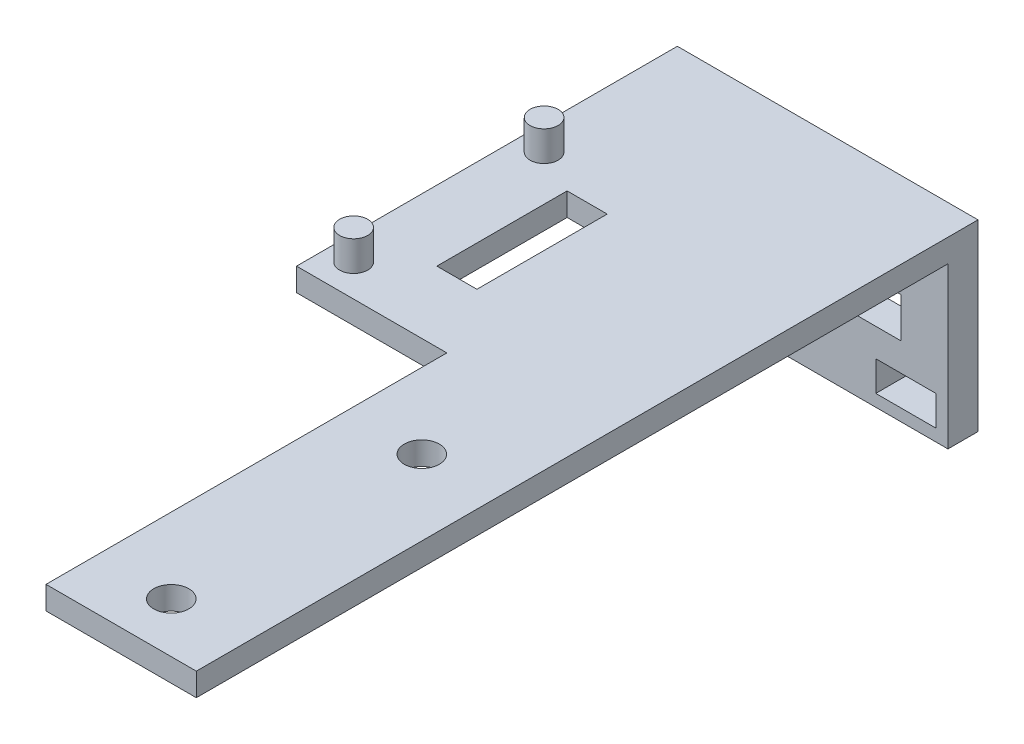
ISO-10303-21;
HEADER;
FILE_DESCRIPTION(('STEP AP214'),'2;1');
FILE_NAME('part.step','',(''),(''),'','','');
FILE_SCHEMA(('AUTOMOTIVE_DESIGN { 1 0 10303 214 1 1 1 1 }'));
ENDSEC;
DATA;
#1=APPLICATION_CONTEXT('core data for automotive mechanical design processes');
#2=APPLICATION_PROTOCOL_DEFINITION('international standard','automotive_design',2000,#1);
#3=PRODUCT_CONTEXT('',#1,'mechanical');
#4=PRODUCT('Part','Part','',(#3));
#5=PRODUCT_RELATED_PRODUCT_CATEGORY('part','',(#4));
#6=PRODUCT_DEFINITION_FORMATION('','',#4);
#7=PRODUCT_DEFINITION_CONTEXT('part definition',#1,'design');
#8=PRODUCT_DEFINITION('design','',#6,#7);
#9=PRODUCT_DEFINITION_SHAPE('','',#8);
#10=(LENGTH_UNIT() NAMED_UNIT(*) SI_UNIT(.MILLI.,.METRE.));
#11=(NAMED_UNIT(*) PLANE_ANGLE_UNIT() SI_UNIT($,.RADIAN.));
#12=(NAMED_UNIT(*) SI_UNIT($,.STERADIAN.) SOLID_ANGLE_UNIT());
#13=UNCERTAINTY_MEASURE_WITH_UNIT(LENGTH_MEASURE(1.E-05),#10,'distance_accuracy_value','');
#14=(GEOMETRIC_REPRESENTATION_CONTEXT(3) GLOBAL_UNCERTAINTY_ASSIGNED_CONTEXT((#13)) GLOBAL_UNIT_ASSIGNED_CONTEXT((#10,
#11,#12)) REPRESENTATION_CONTEXT('',''));
#15=CARTESIAN_POINT('',(0.,0.,0.));
#16=DIRECTION('',(0.,0.,1.));
#17=DIRECTION('',(1.,0.,0.));
#18=AXIS2_PLACEMENT_3D('',#15,#16,#17);
#19=CARTESIAN_POINT('',(-7.5,-2.3,32.5));
#20=DIRECTION('',(0.,0.,1.));
#21=DIRECTION('',(1.,0.,0.));
#22=AXIS2_PLACEMENT_3D('',#19,#20,#21);
#23=PLANE('',#22);
#24=DIRECTION('',(1.,0.,0.));
#25=VECTOR('',#24,1.);
#26=CARTESIAN_POINT('',(-7.5,0.,32.5));
#27=LINE('',#26,#25);
#28=CARTESIAN_POINT('',(-7.5,0.,32.5));
#29=VERTEX_POINT('',#28);
#30=CARTESIAN_POINT('',(7.5,0.,32.5));
#31=VERTEX_POINT('',#30);
#32=EDGE_CURVE('E402',#29,#31,#27,.T.);
#33=ORIENTED_EDGE('',*,*,#32,.F.);
#34=DIRECTION('',(0.,1.,0.));
#35=VECTOR('',#34,1.);
#36=CARTESIAN_POINT('',(-7.5,-2.3,32.5));
#37=LINE('',#36,#35);
#38=CARTESIAN_POINT('',(-7.5,-2.3,32.5));
#39=VERTEX_POINT('',#38);
#40=EDGE_CURVE('E445',#39,#29,#37,.T.);
#41=ORIENTED_EDGE('',*,*,#40,.F.);
#42=DIRECTION('',(1.,0.,0.));
#43=VECTOR('',#42,1.);
#44=CARTESIAN_POINT('',(-7.5,-2.3,32.5));
#45=LINE('',#44,#43);
#46=CARTESIAN_POINT('',(7.5,-2.3,32.5));
#47=VERTEX_POINT('',#46);
#48=EDGE_CURVE('E413',#39,#47,#45,.T.);
#49=ORIENTED_EDGE('',*,*,#48,.T.);
#50=DIRECTION('',(0.,1.,0.));
#51=VECTOR('',#50,1.);
#52=CARTESIAN_POINT('',(7.5,-2.3,32.5));
#53=LINE('',#52,#51);
#54=EDGE_CURVE('E440',#47,#31,#53,.T.);
#55=ORIENTED_EDGE('',*,*,#54,.T.);
#56=EDGE_LOOP('',(#33,#41,#49,#55));
#57=FACE_BOUND('',#56,.T.);
#58=ADVANCED_FACE('F39',(#57),#23,.T.);
#59=CARTESIAN_POINT('',(-7.5,-2.3,-7.50000000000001));
#60=DIRECTION('',(-1.,0.,0.));
#61=DIRECTION('',(0.,0.,1.));
#62=AXIS2_PLACEMENT_3D('',#59,#60,#61);
#63=PLANE('',#62);
#64=DIRECTION('',(0.,0.,1.));
#65=VECTOR('',#64,1.);
#66=CARTESIAN_POINT('',(-7.5,0.,-7.50000000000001));
#67=LINE('',#66,#65);
#68=CARTESIAN_POINT('',(-7.5,0.,-7.50000000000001));
#69=VERTEX_POINT('',#68);
#70=EDGE_CURVE('E433',#69,#29,#67,.T.);
#71=ORIENTED_EDGE('',*,*,#70,.F.);
#72=DIRECTION('',(0.,1.,0.));
#73=VECTOR('',#72,1.);
#74=CARTESIAN_POINT('',(-7.5,-2.3,-7.50000000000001));
#75=LINE('',#74,#73);
#76=CARTESIAN_POINT('',(-7.5,-2.3,-7.50000000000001));
#77=VERTEX_POINT('',#76);
#78=EDGE_CURVE('E448',#77,#69,#75,.T.);
#79=ORIENTED_EDGE('',*,*,#78,.F.);
#80=DIRECTION('',(0.,0.,1.));
#81=VECTOR('',#80,1.);
#82=CARTESIAN_POINT('',(-7.5,-2.3,-7.50000000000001));
#83=LINE('',#82,#81);
#84=EDGE_CURVE('E409',#77,#39,#83,.T.);
#85=ORIENTED_EDGE('',*,*,#84,.T.);
#86=ORIENTED_EDGE('',*,*,#40,.T.);
#87=EDGE_LOOP('',(#71,#79,#85,#86));
#88=FACE_BOUND('',#87,.T.);
#89=ADVANCED_FACE('F522',(#88),#63,.T.);
#90=CARTESIAN_POINT('',(-7.5,-2.3,-7.50000000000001));
#91=DIRECTION('',(0.,0.,1.));
#92=DIRECTION('',(1.,0.,0.));
#93=AXIS2_PLACEMENT_3D('',#90,#91,#92);
#94=PLANE('',#93);
#95=DIRECTION('',(1.,0.,0.));
#96=VECTOR('',#95,1.);
#97=CARTESIAN_POINT('',(-7.5,0.,-7.50000000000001));
#98=LINE('',#97,#96);
#99=CARTESIAN_POINT('',(-22.5,0.,-7.5));
#100=VERTEX_POINT('',#99);
#101=EDGE_CURVE('E429',#100,#69,#98,.T.);
#102=ORIENTED_EDGE('',*,*,#101,.F.);
#103=DIRECTION('',(0.,1.,0.));
#104=VECTOR('',#103,1.);
#105=CARTESIAN_POINT('',(-22.5,-2.3,-7.5));
#106=LINE('',#105,#104);
#107=CARTESIAN_POINT('',(-22.5,-2.3,-7.5));
#108=VERTEX_POINT('',#107);
#109=EDGE_CURVE('E451',#108,#100,#106,.T.);
#110=ORIENTED_EDGE('',*,*,#109,.F.);
#111=DIRECTION('',(1.,0.,0.));
#112=VECTOR('',#111,1.);
#113=CARTESIAN_POINT('',(-7.5,-2.3,-7.50000000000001));
#114=LINE('',#113,#112);
#115=EDGE_CURVE('E405',#108,#77,#114,.T.);
#116=ORIENTED_EDGE('',*,*,#115,.T.);
#117=ORIENTED_EDGE('',*,*,#78,.T.);
#118=EDGE_LOOP('',(#102,#110,#116,#117));
#119=FACE_BOUND('',#118,.T.);
#120=ADVANCED_FACE('F518',(#119),#94,.T.);
#121=CARTESIAN_POINT('',(-22.5,-2.3,-32.5));
#122=DIRECTION('',(-1.,0.,0.));
#123=DIRECTION('',(0.,0.,1.));
#124=AXIS2_PLACEMENT_3D('',#121,#122,#123);
#125=PLANE('',#124);
#126=DIRECTION('',(0.,0.,1.));
#127=VECTOR('',#126,1.);
#128=CARTESIAN_POINT('',(-22.5,0.,-32.5));
#129=LINE('',#128,#127);
#130=CARTESIAN_POINT('',(-22.5,0.,-45.5));
#131=VERTEX_POINT('',#130);
#132=EDGE_CURVE('E425',#131,#100,#129,.T.);
#133=ORIENTED_EDGE('',*,*,#132,.F.);
#134=DIRECTION('',(0.,1.,0.));
#135=VECTOR('',#134,1.);
#136=CARTESIAN_POINT('',(-22.5,-2.3,-45.5));
#137=LINE('',#136,#135);
#138=CARTESIAN_POINT('',(-22.5,-18.3,-45.5));
#139=VERTEX_POINT('',#138);
#140=EDGE_CURVE('E454',#139,#131,#137,.T.);
#141=ORIENTED_EDGE('',*,*,#140,.F.);
#142=DIRECTION('',(0.,0.,1.));
#143=VECTOR('',#142,1.);
#144=CARTESIAN_POINT('',(-22.5,-18.3,0.));
#145=LINE('',#144,#143);
#146=CARTESIAN_POINT('',(-22.5,-18.3,-42.5));
#147=VERTEX_POINT('',#146);
#148=EDGE_CURVE('E307',#139,#147,#145,.T.);
#149=ORIENTED_EDGE('',*,*,#148,.T.);
#150=DIRECTION('',(0.,1.,0.));
#151=VECTOR('',#150,1.);
#152=CARTESIAN_POINT('',(-22.5,-18.3,-42.5));
#153=LINE('',#152,#151);
#154=CARTESIAN_POINT('',(-22.5,-2.3,-42.5));
#155=VERTEX_POINT('',#154);
#156=EDGE_CURVE('E315',#147,#155,#153,.T.);
#157=ORIENTED_EDGE('',*,*,#156,.T.);
#158=DIRECTION('',(0.,0.,1.));
#159=VECTOR('',#158,1.);
#160=CARTESIAN_POINT('',(-22.5,-2.3,-32.5));
#161=LINE('',#160,#159);
#162=EDGE_CURVE('E401',#155,#108,#161,.T.);
#163=ORIENTED_EDGE('',*,*,#162,.T.);
#164=ORIENTED_EDGE('',*,*,#109,.T.);
#165=EDGE_LOOP('',(#133,#141,#149,#157,#163,#164));
#166=FACE_BOUND('',#165,.T.);
#167=ADVANCED_FACE('F511',(#166),#125,.T.);
#168=CARTESIAN_POINT('',(-22.5,-2.3,-45.5));
#169=DIRECTION('',(0.,0.,-1.));
#170=DIRECTION('',(-1.,0.,0.));
#171=AXIS2_PLACEMENT_3D('',#168,#169,#170);
#172=PLANE('',#171);
#173=DIRECTION('',(0.,1.,0.));
#174=VECTOR('',#173,1.);
#175=CARTESIAN_POINT('',(-18.7,-14.1,-45.5));
#176=LINE('',#175,#174);
#177=CARTESIAN_POINT('',(-18.7,-17.1,-45.5));
#178=VERTEX_POINT('',#177);
#179=CARTESIAN_POINT('',(-18.7,-14.1,-45.5));
#180=VERTEX_POINT('',#179);
#181=EDGE_CURVE('E55',#178,#180,#176,.T.);
#182=ORIENTED_EDGE('',*,*,#181,.F.);
#183=DIRECTION('',(-1.,0.,0.));
#184=VECTOR('',#183,1.);
#185=CARTESIAN_POINT('',(-12.7,-17.1,-45.5));
#186=LINE('',#185,#184);
#187=CARTESIAN_POINT('',(-12.7,-17.1,-45.5));
#188=VERTEX_POINT('',#187);
#189=EDGE_CURVE('E251',#188,#178,#186,.T.);
#190=ORIENTED_EDGE('',*,*,#189,.F.);
#191=DIRECTION('',(0.,-1.,0.));
#192=VECTOR('',#191,1.);
#193=CARTESIAN_POINT('',(-12.7,-14.1,-45.5));
#194=LINE('',#193,#192);
#195=CARTESIAN_POINT('',(-12.7,-14.1,-45.5));
#196=VERTEX_POINT('',#195);
#197=EDGE_CURVE('E247',#196,#188,#194,.T.);
#198=ORIENTED_EDGE('',*,*,#197,.F.);
#199=DIRECTION('',(1.,0.,0.));
#200=VECTOR('',#199,1.);
#201=CARTESIAN_POINT('',(-12.7,-14.1,-45.5));
#202=LINE('',#201,#200);
#203=EDGE_CURVE('E243',#180,#196,#202,.T.);
#204=ORIENTED_EDGE('',*,*,#203,.F.);
#205=EDGE_LOOP('',(#182,#190,#198,#204));
#206=FACE_BOUND('',#205,.T.);
#207=DIRECTION('',(0.,1.,0.));
#208=VECTOR('',#207,1.);
#209=CARTESIAN_POINT('',(-15.2,-7.3,-45.5));
#210=LINE('',#209,#208);
#211=CARTESIAN_POINT('',(-15.2,-11.3,-45.5));
#212=VERTEX_POINT('',#211);
#213=CARTESIAN_POINT('',(-15.2,-7.3,-45.5));
#214=VERTEX_POINT('',#213);
#215=EDGE_CURVE('E63',#212,#214,#210,.T.);
#216=ORIENTED_EDGE('',*,*,#215,.F.);
#217=DIRECTION('',(-1.,0.,0.));
#218=VECTOR('',#217,1.);
#219=CARTESIAN_POINT('',(2.79999999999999,-11.3,-45.5));
#220=LINE('',#219,#218);
#221=CARTESIAN_POINT('',(2.79999999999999,-11.3,-45.5));
#222=VERTEX_POINT('',#221);
#223=EDGE_CURVE('E226',#222,#212,#220,.T.);
#224=ORIENTED_EDGE('',*,*,#223,.F.);
#225=DIRECTION('',(0.,-1.,0.));
#226=VECTOR('',#225,1.);
#227=CARTESIAN_POINT('',(2.79999999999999,-7.3,-45.5));
#228=LINE('',#227,#226);
#229=CARTESIAN_POINT('',(2.79999999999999,-7.3,-45.5));
#230=VERTEX_POINT('',#229);
#231=EDGE_CURVE('E207',#230,#222,#228,.T.);
#232=ORIENTED_EDGE('',*,*,#231,.F.);
#233=DIRECTION('',(1.,0.,0.));
#234=VECTOR('',#233,1.);
#235=CARTESIAN_POINT('',(2.79999999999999,-7.3,-45.5));
#236=LINE('',#235,#234);
#237=EDGE_CURVE('E218',#214,#230,#236,.T.);
#238=ORIENTED_EDGE('',*,*,#237,.F.);
#239=EDGE_LOOP('',(#216,#224,#232,#238));
#240=FACE_BOUND('',#239,.T.);
#241=DIRECTION('',(0.,1.,0.));
#242=VECTOR('',#241,1.);
#243=CARTESIAN_POINT('',(0.299999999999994,-14.1,-45.5));
#244=LINE('',#243,#242);
#245=CARTESIAN_POINT('',(0.299999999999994,-17.1,-45.5));
#246=VERTEX_POINT('',#245);
#247=CARTESIAN_POINT('',(0.299999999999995,-14.1,-45.5));
#248=VERTEX_POINT('',#247);
#249=EDGE_CURVE('E236',#246,#248,#244,.T.);
#250=ORIENTED_EDGE('',*,*,#249,.F.);
#251=DIRECTION('',(-1.,0.,0.));
#252=VECTOR('',#251,1.);
#253=CARTESIAN_POINT('',(6.29999999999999,-17.1,-45.5));
#254=LINE('',#253,#252);
#255=CARTESIAN_POINT('',(6.29999999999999,-17.1,-45.5));
#256=VERTEX_POINT('',#255);
#257=EDGE_CURVE('E277',#256,#246,#254,.T.);
#258=ORIENTED_EDGE('',*,*,#257,.F.);
#259=DIRECTION('',(0.,-1.,0.));
#260=VECTOR('',#259,1.);
#261=CARTESIAN_POINT('',(6.29999999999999,-14.1,-45.5));
#262=LINE('',#261,#260);
#263=CARTESIAN_POINT('',(6.29999999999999,-14.1,-45.5));
#264=VERTEX_POINT('',#263);
#265=EDGE_CURVE('E273',#264,#256,#262,.T.);
#266=ORIENTED_EDGE('',*,*,#265,.F.);
#267=DIRECTION('',(1.,0.,0.));
#268=VECTOR('',#267,1.);
#269=CARTESIAN_POINT('',(6.29999999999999,-14.1,-45.5));
#270=LINE('',#269,#268);
#271=EDGE_CURVE('E269',#248,#264,#270,.T.);
#272=ORIENTED_EDGE('',*,*,#271,.F.);
#273=EDGE_LOOP('',(#250,#258,#266,#272));
#274=FACE_BOUND('',#273,.T.);
#275=DIRECTION('',(-1.,0.,0.));
#276=VECTOR('',#275,1.);
#277=CARTESIAN_POINT('',(-22.5,0.,-45.5));
#278=LINE('',#277,#276);
#279=CARTESIAN_POINT('',(7.49999999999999,0.,-45.5));
#280=VERTEX_POINT('',#279);
#281=EDGE_CURVE('E421',#280,#131,#278,.T.);
#282=ORIENTED_EDGE('',*,*,#281,.F.);
#283=DIRECTION('',(0.,1.,0.));
#284=VECTOR('',#283,1.);
#285=CARTESIAN_POINT('',(7.49999999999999,-2.3,-45.5));
#286=LINE('',#285,#284);
#287=CARTESIAN_POINT('',(7.49999999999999,-18.3,-45.5));
#288=VERTEX_POINT('',#287);
#289=EDGE_CURVE('E417',#288,#280,#286,.T.);
#290=ORIENTED_EDGE('',*,*,#289,.F.);
#291=DIRECTION('',(-1.,0.,0.));
#292=VECTOR('',#291,1.);
#293=CARTESIAN_POINT('',(0.,-18.3,-45.5));
#294=LINE('',#293,#292);
#295=EDGE_CURVE('E303',#288,#139,#294,.T.);
#296=ORIENTED_EDGE('',*,*,#295,.T.);
#297=ORIENTED_EDGE('',*,*,#140,.T.);
#298=EDGE_LOOP('',(#282,#290,#296,#297));
#299=FACE_BOUND('',#298,.T.);
#300=ADVANCED_FACE('F223',(#206,#240,#274,#299),#172,.T.);
#301=CARTESIAN_POINT('',(7.49999999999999,-2.3,-32.5));
#302=DIRECTION('',(1.,0.,0.));
#303=DIRECTION('',(0.,0.,-1.));
#304=AXIS2_PLACEMENT_3D('',#301,#302,#303);
#305=PLANE('',#304);
#306=DIRECTION('',(0.,0.,-1.));
#307=VECTOR('',#306,1.);
#308=CARTESIAN_POINT('',(7.49999999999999,0.,-32.5));
#309=LINE('',#308,#307);
#310=EDGE_CURVE('E393',#31,#280,#309,.T.);
#311=ORIENTED_EDGE('',*,*,#310,.F.);
#312=ORIENTED_EDGE('',*,*,#54,.F.);
#313=DIRECTION('',(0.,0.,-1.));
#314=VECTOR('',#313,1.);
#315=CARTESIAN_POINT('',(7.49999999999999,-2.3,-32.5));
#316=LINE('',#315,#314);
#317=CARTESIAN_POINT('',(7.49999999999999,-2.3,-42.5));
#318=VERTEX_POINT('',#317);
#319=EDGE_CURVE('E397',#47,#318,#316,.T.);
#320=ORIENTED_EDGE('',*,*,#319,.T.);
#321=DIRECTION('',(0.,1.,0.));
#322=VECTOR('',#321,1.);
#323=CARTESIAN_POINT('',(7.5,-18.3,-42.5));
#324=LINE('',#323,#322);
#325=CARTESIAN_POINT('',(7.5,-18.3,-42.5));
#326=VERTEX_POINT('',#325);
#327=EDGE_CURVE('E311',#326,#318,#324,.T.);
#328=ORIENTED_EDGE('',*,*,#327,.F.);
#329=DIRECTION('',(0.,0.,-1.));
#330=VECTOR('',#329,1.);
#331=CARTESIAN_POINT('',(7.50000000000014,-18.3,0.));
#332=LINE('',#331,#330);
#333=EDGE_CURVE('E299',#326,#288,#332,.T.);
#334=ORIENTED_EDGE('',*,*,#333,.T.);
#335=ORIENTED_EDGE('',*,*,#289,.T.);
#336=EDGE_LOOP('',(#311,#312,#320,#328,#334,#335));
#337=FACE_BOUND('',#336,.T.);
#338=ADVANCED_FACE('F41',(#337),#305,.T.);
#339=CARTESIAN_POINT('',(0.,-2.3,0.));
#340=DIRECTION('',(0.,1.,0.));
#341=DIRECTION('',(0.,0.,1.));
#342=AXIS2_PLACEMENT_3D('',#339,#340,#341);
#343=PLANE('',#342);
#344=DIRECTION('',(1.,0.,0.));
#345=VECTOR('',#344,1.);
#346=CARTESIAN_POINT('',(-15.5,-2.3,-14.5));
#347=LINE('',#346,#345);
#348=CARTESIAN_POINT('',(-15.5,-2.3,-14.5));
#349=VERTEX_POINT('',#348);
#350=CARTESIAN_POINT('',(-11.5,-2.3,-14.5));
#351=VERTEX_POINT('',#350);
#352=EDGE_CURVE('E350',#349,#351,#347,.T.);
#353=ORIENTED_EDGE('',*,*,#352,.T.);
#354=DIRECTION('',(0.,0.,-1.));
#355=VECTOR('',#354,1.);
#356=CARTESIAN_POINT('',(-11.5,-2.3,-27.5));
#357=LINE('',#356,#355);
#358=CARTESIAN_POINT('',(-11.5,-2.3,-27.5));
#359=VERTEX_POINT('',#358);
#360=EDGE_CURVE('E337',#351,#359,#357,.T.);
#361=ORIENTED_EDGE('',*,*,#360,.T.);
#362=DIRECTION('',(-1.,0.,0.));
#363=VECTOR('',#362,1.);
#364=CARTESIAN_POINT('',(-15.5,-2.3,-27.5));
#365=LINE('',#364,#363);
#366=CARTESIAN_POINT('',(-15.5,-2.3,-27.5));
#367=VERTEX_POINT('',#366);
#368=EDGE_CURVE('E341',#359,#367,#365,.T.);
#369=ORIENTED_EDGE('',*,*,#368,.T.);
#370=DIRECTION('',(0.,0.,1.));
#371=VECTOR('',#370,1.);
#372=CARTESIAN_POINT('',(-15.5,-2.3,-27.5));
#373=LINE('',#372,#371);
#374=EDGE_CURVE('E346',#367,#349,#373,.T.);
#375=ORIENTED_EDGE('',*,*,#374,.T.);
#376=EDGE_LOOP('',(#353,#361,#369,#375));
#377=FACE_BOUND('',#376,.T.);
#378=CARTESIAN_POINT('',(0.,-2.3,2.5));
#379=DIRECTION('',(0.,1.,0.));
#380=DIRECTION('',(0.,0.,1.));
#381=AXIS2_PLACEMENT_3D('',#378,#379,#380);
#382=CIRCLE('',#381,1.75);
#383=CARTESIAN_POINT('',(0.,-2.3,4.24999999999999));
#384=VERTEX_POINT('',#383);
#385=EDGE_CURVE('E381',#384,#384,#382,.T.);
#386=ORIENTED_EDGE('',*,*,#385,.T.);
#387=EDGE_LOOP('',(#386));
#388=FACE_BOUND('',#387,.T.);
#389=CARTESIAN_POINT('',(0.,-2.3,27.5));
#390=DIRECTION('',(0.,1.,0.));
#391=DIRECTION('',(0.,0.,1.));
#392=AXIS2_PLACEMENT_3D('',#389,#390,#391);
#393=CIRCLE('',#392,1.75);
#394=CARTESIAN_POINT('',(0.,-2.3,29.25));
#395=VERTEX_POINT('',#394);
#396=EDGE_CURVE('E389',#395,#395,#393,.T.);
#397=ORIENTED_EDGE('',*,*,#396,.T.);
#398=EDGE_LOOP('',(#397));
#399=FACE_BOUND('',#398,.T.);
#400=ORIENTED_EDGE('',*,*,#162,.F.);
#401=DIRECTION('',(1.,0.,0.));
#402=VECTOR('',#401,1.);
#403=CARTESIAN_POINT('',(0.,-2.3,-42.5));
#404=LINE('',#403,#402);
#405=EDGE_CURVE('E285',#155,#318,#404,.T.);
#406=ORIENTED_EDGE('',*,*,#405,.T.);
#407=ORIENTED_EDGE('',*,*,#319,.F.);
#408=ORIENTED_EDGE('',*,*,#48,.F.);
#409=ORIENTED_EDGE('',*,*,#84,.F.);
#410=ORIENTED_EDGE('',*,*,#115,.F.);
#411=EDGE_LOOP('',(#400,#406,#407,#408,#409,#410));
#412=FACE_BOUND('',#411,.T.);
#413=ADVANCED_FACE('F516',(#377,#388,#399,#412),#343,.F.);
#414=CARTESIAN_POINT('',(0.,0.,0.));
#415=DIRECTION('',(0.,1.,0.));
#416=DIRECTION('',(0.,0.,1.));
#417=AXIS2_PLACEMENT_3D('',#414,#415,#416);
#418=PLANE('',#417);
#419=CARTESIAN_POINT('',(-20.,0.,-10.7));
#420=DIRECTION('',(0.,1.,0.));
#421=DIRECTION('',(0.,0.,1.));
#422=AXIS2_PLACEMENT_3D('',#419,#420,#421);
#423=CIRCLE('',#422,1.4);
#424=CARTESIAN_POINT('',(-20.,0.,-9.3));
#425=VERTEX_POINT('',#424);
#426=EDGE_CURVE('E318',#425,#425,#423,.T.);
#427=ORIENTED_EDGE('',*,*,#426,.F.);
#428=EDGE_LOOP('',(#427));
#429=FACE_BOUND('',#428,.T.);
#430=CARTESIAN_POINT('',(-20.,0.,-29.7));
#431=DIRECTION('',(0.,1.,0.));
#432=DIRECTION('',(0.,0.,1.));
#433=AXIS2_PLACEMENT_3D('',#430,#431,#432);
#434=CIRCLE('',#433,1.4);
#435=CARTESIAN_POINT('',(-20.,0.,-28.3));
#436=VERTEX_POINT('',#435);
#437=EDGE_CURVE('E325',#436,#436,#434,.T.);
#438=ORIENTED_EDGE('',*,*,#437,.F.);
#439=EDGE_LOOP('',(#438));
#440=FACE_BOUND('',#439,.T.);
#441=DIRECTION('',(0.,0.,-1.));
#442=VECTOR('',#441,1.);
#443=CARTESIAN_POINT('',(-11.5,0.,-27.5));
#444=LINE('',#443,#442);
#445=CARTESIAN_POINT('',(-11.5,0.,-14.5));
#446=VERTEX_POINT('',#445);
#447=CARTESIAN_POINT('',(-11.5,0.,-27.5));
#448=VERTEX_POINT('',#447);
#449=EDGE_CURVE('E333',#446,#448,#444,.T.);
#450=ORIENTED_EDGE('',*,*,#449,.F.);
#451=DIRECTION('',(1.,0.,0.));
#452=VECTOR('',#451,1.);
#453=CARTESIAN_POINT('',(-15.5,0.,-14.5));
#454=LINE('',#453,#452);
#455=CARTESIAN_POINT('',(-15.5,0.,-14.5));
#456=VERTEX_POINT('',#455);
#457=EDGE_CURVE('E342',#456,#446,#454,.T.);
#458=ORIENTED_EDGE('',*,*,#457,.F.);
#459=DIRECTION('',(0.,0.,1.));
#460=VECTOR('',#459,1.);
#461=CARTESIAN_POINT('',(-15.5,0.,-27.5));
#462=LINE('',#461,#460);
#463=CARTESIAN_POINT('',(-15.5,0.,-27.5));
#464=VERTEX_POINT('',#463);
#465=EDGE_CURVE('E361',#464,#456,#462,.T.);
#466=ORIENTED_EDGE('',*,*,#465,.F.);
#467=DIRECTION('',(-1.,0.,0.));
#468=VECTOR('',#467,1.);
#469=CARTESIAN_POINT('',(-15.5,0.,-27.5));
#470=LINE('',#469,#468);
#471=EDGE_CURVE('E357',#448,#464,#470,.T.);
#472=ORIENTED_EDGE('',*,*,#471,.F.);
#473=EDGE_LOOP('',(#450,#458,#466,#472));
#474=FACE_BOUND('',#473,.T.);
#475=CARTESIAN_POINT('',(0.,0.,2.5));
#476=DIRECTION('',(0.,1.,0.));
#477=DIRECTION('',(0.,0.,1.));
#478=AXIS2_PLACEMENT_3D('',#475,#476,#477);
#479=CIRCLE('',#478,1.75);
#480=CARTESIAN_POINT('',(0.,0.,4.24999999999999));
#481=VERTEX_POINT('',#480);
#482=EDGE_CURVE('E371',#481,#481,#479,.T.);
#483=ORIENTED_EDGE('',*,*,#482,.F.);
#484=EDGE_LOOP('',(#483));
#485=FACE_BOUND('',#484,.T.);
#486=CARTESIAN_POINT('',(0.,0.,27.5));
#487=DIRECTION('',(0.,1.,0.));
#488=DIRECTION('',(0.,0.,1.));
#489=AXIS2_PLACEMENT_3D('',#486,#487,#488);
#490=CIRCLE('',#489,1.75);
#491=CARTESIAN_POINT('',(0.,0.,29.25));
#492=VERTEX_POINT('',#491);
#493=EDGE_CURVE('E385',#492,#492,#490,.T.);
#494=ORIENTED_EDGE('',*,*,#493,.F.);
#495=EDGE_LOOP('',(#494));
#496=FACE_BOUND('',#495,.T.);
#497=ORIENTED_EDGE('',*,*,#32,.T.);
#498=ORIENTED_EDGE('',*,*,#310,.T.);
#499=ORIENTED_EDGE('',*,*,#281,.T.);
#500=ORIENTED_EDGE('',*,*,#132,.T.);
#501=ORIENTED_EDGE('',*,*,#101,.T.);
#502=ORIENTED_EDGE('',*,*,#70,.T.);
#503=EDGE_LOOP('',(#497,#498,#499,#500,#501,#502));
#504=FACE_BOUND('',#503,.T.);
#505=ADVANCED_FACE('F532',(#429,#440,#474,#485,#496,#504),#418,.T.);
#506=CARTESIAN_POINT('',(0.,-2.3,27.5));
#507=DIRECTION('',(0.,1.,0.));
#508=DIRECTION('',(0.,0.,1.));
#509=AXIS2_PLACEMENT_3D('',#506,#507,#508);
#510=CYLINDRICAL_SURFACE('',#509,1.75);
#511=ORIENTED_EDGE('',*,*,#396,.F.);
#512=EDGE_LOOP('',(#511));
#513=FACE_BOUND('',#512,.T.);
#514=ORIENTED_EDGE('',*,*,#493,.T.);
#515=EDGE_LOOP('',(#514));
#516=FACE_BOUND('',#515,.T.);
#517=ADVANCED_FACE('F564',(#513,#516),#510,.F.);
#518=CARTESIAN_POINT('',(0.,-2.3,2.5));
#519=DIRECTION('',(0.,1.,0.));
#520=DIRECTION('',(0.,0.,1.));
#521=AXIS2_PLACEMENT_3D('',#518,#519,#520);
#522=CYLINDRICAL_SURFACE('',#521,1.75);
#523=ORIENTED_EDGE('',*,*,#385,.F.);
#524=EDGE_LOOP('',(#523));
#525=FACE_BOUND('',#524,.T.);
#526=ORIENTED_EDGE('',*,*,#482,.T.);
#527=EDGE_LOOP('',(#526));
#528=FACE_BOUND('',#527,.T.);
#529=ADVANCED_FACE('F570',(#525,#528),#522,.F.);
#530=CARTESIAN_POINT('',(-11.5,-2.3,-27.5));
#531=DIRECTION('',(1.,0.,0.));
#532=DIRECTION('',(0.,0.,-1.));
#533=AXIS2_PLACEMENT_3D('',#530,#531,#532);
#534=PLANE('',#533);
#535=ORIENTED_EDGE('',*,*,#449,.T.);
#536=DIRECTION('',(0.,1.,0.));
#537=VECTOR('',#536,1.);
#538=CARTESIAN_POINT('',(-11.5,-2.3,-27.5));
#539=LINE('',#538,#537);
#540=EDGE_CURVE('E354',#359,#448,#539,.T.);
#541=ORIENTED_EDGE('',*,*,#540,.F.);
#542=ORIENTED_EDGE('',*,*,#360,.F.);
#543=DIRECTION('',(0.,1.,0.));
#544=VECTOR('',#543,1.);
#545=CARTESIAN_POINT('',(-11.5,-2.3,-14.5));
#546=LINE('',#545,#544);
#547=EDGE_CURVE('E368',#351,#446,#546,.T.);
#548=ORIENTED_EDGE('',*,*,#547,.T.);
#549=EDGE_LOOP('',(#535,#541,#542,#548));
#550=FACE_BOUND('',#549,.T.);
#551=ADVANCED_FACE('F574',(#550),#534,.F.);
#552=CARTESIAN_POINT('',(-15.5,-2.3,-14.5));
#553=DIRECTION('',(0.,0.,1.));
#554=DIRECTION('',(1.,0.,0.));
#555=AXIS2_PLACEMENT_3D('',#552,#553,#554);
#556=PLANE('',#555);
#557=ORIENTED_EDGE('',*,*,#457,.T.);
#558=ORIENTED_EDGE('',*,*,#547,.F.);
#559=ORIENTED_EDGE('',*,*,#352,.F.);
#560=DIRECTION('',(0.,1.,0.));
#561=VECTOR('',#560,1.);
#562=CARTESIAN_POINT('',(-15.5,-2.3,-14.5));
#563=LINE('',#562,#561);
#564=EDGE_CURVE('E372',#349,#456,#563,.T.);
#565=ORIENTED_EDGE('',*,*,#564,.T.);
#566=EDGE_LOOP('',(#557,#558,#559,#565));
#567=FACE_BOUND('',#566,.T.);
#568=ADVANCED_FACE('F578',(#567),#556,.F.);
#569=CARTESIAN_POINT('',(-15.5,-2.3,-27.5));
#570=DIRECTION('',(-1.,0.,0.));
#571=DIRECTION('',(0.,0.,1.));
#572=AXIS2_PLACEMENT_3D('',#569,#570,#571);
#573=PLANE('',#572);
#574=ORIENTED_EDGE('',*,*,#465,.T.);
#575=ORIENTED_EDGE('',*,*,#564,.F.);
#576=ORIENTED_EDGE('',*,*,#374,.F.);
#577=DIRECTION('',(0.,1.,0.));
#578=VECTOR('',#577,1.);
#579=CARTESIAN_POINT('',(-15.5,-2.3,-27.5));
#580=LINE('',#579,#578);
#581=EDGE_CURVE('E375',#367,#464,#580,.T.);
#582=ORIENTED_EDGE('',*,*,#581,.T.);
#583=EDGE_LOOP('',(#574,#575,#576,#582));
#584=FACE_BOUND('',#583,.T.);
#585=ADVANCED_FACE('F584',(#584),#573,.F.);
#586=CARTESIAN_POINT('',(-15.5,-2.3,-27.5));
#587=DIRECTION('',(0.,0.,-1.));
#588=DIRECTION('',(-1.,0.,0.));
#589=AXIS2_PLACEMENT_3D('',#586,#587,#588);
#590=PLANE('',#589);
#591=ORIENTED_EDGE('',*,*,#471,.T.);
#592=ORIENTED_EDGE('',*,*,#581,.F.);
#593=ORIENTED_EDGE('',*,*,#368,.F.);
#594=ORIENTED_EDGE('',*,*,#540,.T.);
#595=EDGE_LOOP('',(#591,#592,#593,#594));
#596=FACE_BOUND('',#595,.T.);
#597=ADVANCED_FACE('F580',(#596),#590,.F.);
#598=CARTESIAN_POINT('',(-20.,3.,-29.7));
#599=DIRECTION('',(0.,-1.,0.));
#600=DIRECTION('',(0.,0.,-1.));
#601=AXIS2_PLACEMENT_3D('',#598,#599,#600);
#602=CYLINDRICAL_SURFACE('',#601,1.4);
#603=CARTESIAN_POINT('',(-20.,3.,-29.7));
#604=DIRECTION('',(0.,1.,0.));
#605=DIRECTION('',(0.,0.,1.));
#606=AXIS2_PLACEMENT_3D('',#603,#604,#605);
#607=CIRCLE('',#606,1.4);
#608=CARTESIAN_POINT('',(-20.,3.,-28.3));
#609=VERTEX_POINT('',#608);
#610=EDGE_CURVE('E329',#609,#609,#607,.T.);
#611=ORIENTED_EDGE('',*,*,#610,.F.);
#612=EDGE_LOOP('',(#611));
#613=FACE_BOUND('',#612,.T.);
#614=ORIENTED_EDGE('',*,*,#437,.T.);
#615=EDGE_LOOP('',(#614));
#616=FACE_BOUND('',#615,.T.);
#617=ADVANCED_FACE('F583',(#613,#616),#602,.T.);
#618=CARTESIAN_POINT('',(-20.,3.,-29.7));
#619=DIRECTION('',(0.,1.,0.));
#620=DIRECTION('',(0.,0.,1.));
#621=AXIS2_PLACEMENT_3D('',#618,#619,#620);
#622=PLANE('',#621);
#623=ORIENTED_EDGE('',*,*,#610,.T.);
#624=EDGE_LOOP('',(#623));
#625=FACE_BOUND('',#624,.T.);
#626=ADVANCED_FACE('F594',(#625),#622,.T.);
#627=CARTESIAN_POINT('',(-20.,3.,-10.7));
#628=DIRECTION('',(0.,-1.,0.));
#629=DIRECTION('',(0.,0.,-1.));
#630=AXIS2_PLACEMENT_3D('',#627,#628,#629);
#631=CYLINDRICAL_SURFACE('',#630,1.4);
#632=CARTESIAN_POINT('',(-20.,3.,-10.7));
#633=DIRECTION('',(0.,1.,0.));
#634=DIRECTION('',(0.,0.,1.));
#635=AXIS2_PLACEMENT_3D('',#632,#633,#634);
#636=CIRCLE('',#635,1.4);
#637=CARTESIAN_POINT('',(-20.,3.,-9.3));
#638=VERTEX_POINT('',#637);
#639=EDGE_CURVE('E321',#638,#638,#636,.T.);
#640=ORIENTED_EDGE('',*,*,#639,.F.);
#641=EDGE_LOOP('',(#640));
#642=FACE_BOUND('',#641,.T.);
#643=ORIENTED_EDGE('',*,*,#426,.T.);
#644=EDGE_LOOP('',(#643));
#645=FACE_BOUND('',#644,.T.);
#646=ADVANCED_FACE('F598',(#642,#645),#631,.T.);
#647=CARTESIAN_POINT('',(-20.,3.,-10.7));
#648=DIRECTION('',(0.,1.,0.));
#649=DIRECTION('',(0.,0.,1.));
#650=AXIS2_PLACEMENT_3D('',#647,#648,#649);
#651=PLANE('',#650);
#652=ORIENTED_EDGE('',*,*,#639,.T.);
#653=EDGE_LOOP('',(#652));
#654=FACE_BOUND('',#653,.T.);
#655=ADVANCED_FACE('F602',(#654),#651,.T.);
#656=CARTESIAN_POINT('',(0.,-18.3,-42.5));
#657=DIRECTION('',(0.,0.,1.));
#658=DIRECTION('',(1.,0.,0.));
#659=AXIS2_PLACEMENT_3D('',#656,#657,#658);
#660=PLANE('',#659);
#661=DIRECTION('',(0.,-1.,0.));
#662=VECTOR('',#661,1.);
#663=CARTESIAN_POINT('',(-18.7,-18.3,-42.5));
#664=LINE('',#663,#662);
#665=CARTESIAN_POINT('',(-18.7,-14.1,-42.5));
#666=VERTEX_POINT('',#665);
#667=CARTESIAN_POINT('',(-18.7,-17.1,-42.5));
#668=VERTEX_POINT('',#667);
#669=EDGE_CURVE('E11',#666,#668,#664,.T.);
#670=ORIENTED_EDGE('',*,*,#669,.F.);
#671=DIRECTION('',(-1.,0.,0.));
#672=VECTOR('',#671,1.);
#673=CARTESIAN_POINT('',(0.,-14.1,-42.5));
#674=LINE('',#673,#672);
#675=CARTESIAN_POINT('',(-12.7,-14.1,-42.5));
#676=VERTEX_POINT('',#675);
#677=EDGE_CURVE('E483',#676,#666,#674,.T.);
#678=ORIENTED_EDGE('',*,*,#677,.F.);
#679=DIRECTION('',(0.,1.,0.));
#680=VECTOR('',#679,1.);
#681=CARTESIAN_POINT('',(-12.7,-18.3,-42.5));
#682=LINE('',#681,#680);
#683=CARTESIAN_POINT('',(-12.7,-17.1,-42.5));
#684=VERTEX_POINT('',#683);
#685=EDGE_CURVE('E486',#684,#676,#682,.T.);
#686=ORIENTED_EDGE('',*,*,#685,.F.);
#687=DIRECTION('',(1.,0.,0.));
#688=VECTOR('',#687,1.);
#689=CARTESIAN_POINT('',(0.,-17.1,-42.5));
#690=LINE('',#689,#688);
#691=EDGE_CURVE('E48',#668,#684,#690,.T.);
#692=ORIENTED_EDGE('',*,*,#691,.F.);
#693=EDGE_LOOP('',(#670,#678,#686,#692));
#694=FACE_BOUND('',#693,.T.);
#695=DIRECTION('',(0.,-1.,0.));
#696=VECTOR('',#695,1.);
#697=CARTESIAN_POINT('',(-15.2,-18.3,-42.5));
#698=LINE('',#697,#696);
#699=CARTESIAN_POINT('',(-15.2,-7.3,-42.5));
#700=VERTEX_POINT('',#699);
#701=CARTESIAN_POINT('',(-15.2,-11.3,-42.5));
#702=VERTEX_POINT('',#701);
#703=EDGE_CURVE('E480',#700,#702,#698,.T.);
#704=ORIENTED_EDGE('',*,*,#703,.F.);
#705=DIRECTION('',(-1.,0.,0.));
#706=VECTOR('',#705,1.);
#707=CARTESIAN_POINT('',(0.,-7.3,-42.5));
#708=LINE('',#707,#706);
#709=CARTESIAN_POINT('',(2.79999999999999,-7.3,-42.5));
#710=VERTEX_POINT('',#709);
#711=EDGE_CURVE('E472',#710,#700,#708,.T.);
#712=ORIENTED_EDGE('',*,*,#711,.F.);
#713=DIRECTION('',(0.,1.,0.));
#714=VECTOR('',#713,1.);
#715=CARTESIAN_POINT('',(2.79999999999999,-18.3,-42.5));
#716=LINE('',#715,#714);
#717=CARTESIAN_POINT('',(2.79999999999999,-11.3,-42.5));
#718=VERTEX_POINT('',#717);
#719=EDGE_CURVE('E210',#718,#710,#716,.T.);
#720=ORIENTED_EDGE('',*,*,#719,.F.);
#721=DIRECTION('',(1.,0.,0.));
#722=VECTOR('',#721,1.);
#723=CARTESIAN_POINT('',(0.,-11.3,-42.5));
#724=LINE('',#723,#722);
#725=EDGE_CURVE('E477',#702,#718,#724,.T.);
#726=ORIENTED_EDGE('',*,*,#725,.F.);
#727=EDGE_LOOP('',(#704,#712,#720,#726));
#728=FACE_BOUND('',#727,.T.);
#729=DIRECTION('',(0.,-1.,0.));
#730=VECTOR('',#729,1.);
#731=CARTESIAN_POINT('',(0.299999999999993,-18.3,-42.5));
#732=LINE('',#731,#730);
#733=CARTESIAN_POINT('',(0.299999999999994,-14.1,-42.5));
#734=VERTEX_POINT('',#733);
#735=CARTESIAN_POINT('',(0.299999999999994,-17.1,-42.5));
#736=VERTEX_POINT('',#735);
#737=EDGE_CURVE('E469',#734,#736,#732,.T.);
#738=ORIENTED_EDGE('',*,*,#737,.F.);
#739=DIRECTION('',(-1.,0.,0.));
#740=VECTOR('',#739,1.);
#741=CARTESIAN_POINT('',(0.,-14.1,-42.5));
#742=LINE('',#741,#740);
#743=CARTESIAN_POINT('',(6.29999999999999,-14.1,-42.5));
#744=VERTEX_POINT('',#743);
#745=EDGE_CURVE('E444',#744,#734,#742,.T.);
#746=ORIENTED_EDGE('',*,*,#745,.F.);
#747=DIRECTION('',(0.,1.,0.));
#748=VECTOR('',#747,1.);
#749=CARTESIAN_POINT('',(6.29999999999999,-18.3,-42.5));
#750=LINE('',#749,#748);
#751=CARTESIAN_POINT('',(6.29999999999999,-17.1,-42.5));
#752=VERTEX_POINT('',#751);
#753=EDGE_CURVE('E462',#752,#744,#750,.T.);
#754=ORIENTED_EDGE('',*,*,#753,.F.);
#755=DIRECTION('',(1.,0.,0.));
#756=VECTOR('',#755,1.);
#757=CARTESIAN_POINT('',(0.,-17.1,-42.5));
#758=LINE('',#757,#756);
#759=EDGE_CURVE('E466',#736,#752,#758,.T.);
#760=ORIENTED_EDGE('',*,*,#759,.F.);
#761=EDGE_LOOP('',(#738,#746,#754,#760));
#762=FACE_BOUND('',#761,.T.);
#763=ORIENTED_EDGE('',*,*,#405,.F.);
#764=ORIENTED_EDGE('',*,*,#156,.F.);
#765=DIRECTION('',(1.,0.,0.));
#766=VECTOR('',#765,1.);
#767=CARTESIAN_POINT('',(0.,-18.3,-42.5));
#768=LINE('',#767,#766);
#769=EDGE_CURVE('E295',#147,#326,#768,.T.);
#770=ORIENTED_EDGE('',*,*,#769,.T.);
#771=ORIENTED_EDGE('',*,*,#327,.T.);
#772=EDGE_LOOP('',(#763,#764,#770,#771));
#773=FACE_BOUND('',#772,.T.);
#774=ADVANCED_FACE('F503',(#694,#728,#762,#773),#660,.T.);
#775=CARTESIAN_POINT('',(0.,-18.3,0.));
#776=DIRECTION('',(0.,1.,0.));
#777=DIRECTION('',(0.,0.,1.));
#778=AXIS2_PLACEMENT_3D('',#775,#776,#777);
#779=PLANE('',#778);
#780=ORIENTED_EDGE('',*,*,#769,.F.);
#781=ORIENTED_EDGE('',*,*,#148,.F.);
#782=ORIENTED_EDGE('',*,*,#295,.F.);
#783=ORIENTED_EDGE('',*,*,#333,.F.);
#784=EDGE_LOOP('',(#780,#781,#782,#783));
#785=FACE_BOUND('',#784,.T.);
#786=ADVANCED_FACE('F551',(#785),#779,.F.);
#787=CARTESIAN_POINT('',(0.299999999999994,-14.1,32.5));
#788=DIRECTION('',(-1.,0.,0.));
#789=DIRECTION('',(0.,-1.,0.));
#790=AXIS2_PLACEMENT_3D('',#787,#788,#789);
#791=PLANE('',#790);
#792=ORIENTED_EDGE('',*,*,#737,.T.);
#793=DIRECTION('',(0.,0.,-1.));
#794=VECTOR('',#793,1.);
#795=CARTESIAN_POINT('',(0.299999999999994,-17.1,32.5));
#796=LINE('',#795,#794);
#797=EDGE_CURVE('E282',#736,#246,#796,.T.);
#798=ORIENTED_EDGE('',*,*,#797,.T.);
#799=ORIENTED_EDGE('',*,*,#249,.T.);
#800=DIRECTION('',(0.,0.,-1.));
#801=VECTOR('',#800,1.);
#802=CARTESIAN_POINT('',(0.299999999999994,-14.1,32.5));
#803=LINE('',#802,#801);
#804=EDGE_CURVE('E281',#734,#248,#803,.T.);
#805=ORIENTED_EDGE('',*,*,#804,.F.);
#806=EDGE_LOOP('',(#792,#798,#799,#805));
#807=FACE_BOUND('',#806,.T.);
#808=ADVANCED_FACE('F611',(#807),#791,.F.);
#809=CARTESIAN_POINT('',(6.29999999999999,-17.1,32.5));
#810=DIRECTION('',(0.,-1.,0.));
#811=DIRECTION('',(0.,0.,-1.));
#812=AXIS2_PLACEMENT_3D('',#809,#810,#811);
#813=PLANE('',#812);
#814=ORIENTED_EDGE('',*,*,#759,.T.);
#815=DIRECTION('',(0.,0.,-1.));
#816=VECTOR('',#815,1.);
#817=CARTESIAN_POINT('',(6.29999999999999,-17.1,32.5));
#818=LINE('',#817,#816);
#819=EDGE_CURVE('E286',#752,#256,#818,.T.);
#820=ORIENTED_EDGE('',*,*,#819,.T.);
#821=ORIENTED_EDGE('',*,*,#257,.T.);
#822=ORIENTED_EDGE('',*,*,#797,.F.);
#823=EDGE_LOOP('',(#814,#820,#821,#822));
#824=FACE_BOUND('',#823,.T.);
#825=ADVANCED_FACE('F614',(#824),#813,.F.);
#826=CARTESIAN_POINT('',(6.29999999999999,-14.1,32.5));
#827=DIRECTION('',(1.,0.,0.));
#828=DIRECTION('',(0.,1.,0.));
#829=AXIS2_PLACEMENT_3D('',#826,#827,#828);
#830=PLANE('',#829);
#831=ORIENTED_EDGE('',*,*,#753,.T.);
#832=DIRECTION('',(0.,0.,-1.));
#833=VECTOR('',#832,1.);
#834=CARTESIAN_POINT('',(6.29999999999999,-14.1,32.5));
#835=LINE('',#834,#833);
#836=EDGE_CURVE('E289',#744,#264,#835,.T.);
#837=ORIENTED_EDGE('',*,*,#836,.T.);
#838=ORIENTED_EDGE('',*,*,#265,.T.);
#839=ORIENTED_EDGE('',*,*,#819,.F.);
#840=EDGE_LOOP('',(#831,#837,#838,#839));
#841=FACE_BOUND('',#840,.T.);
#842=ADVANCED_FACE('F620',(#841),#830,.F.);
#843=CARTESIAN_POINT('',(6.29999999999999,-14.1,32.5));
#844=DIRECTION('',(0.,1.,0.));
#845=DIRECTION('',(0.,0.,1.));
#846=AXIS2_PLACEMENT_3D('',#843,#844,#845);
#847=PLANE('',#846);
#848=ORIENTED_EDGE('',*,*,#745,.T.);
#849=ORIENTED_EDGE('',*,*,#804,.T.);
#850=ORIENTED_EDGE('',*,*,#271,.T.);
#851=ORIENTED_EDGE('',*,*,#836,.F.);
#852=EDGE_LOOP('',(#848,#849,#850,#851));
#853=FACE_BOUND('',#852,.T.);
#854=ADVANCED_FACE('F616',(#853),#847,.F.);
#855=CARTESIAN_POINT('',(-15.2,-7.3,32.5));
#856=DIRECTION('',(-1.,0.,0.));
#857=DIRECTION('',(0.,0.,1.));
#858=AXIS2_PLACEMENT_3D('',#855,#856,#857);
#859=PLANE('',#858);
#860=ORIENTED_EDGE('',*,*,#703,.T.);
#861=DIRECTION('',(0.,0.,-1.));
#862=VECTOR('',#861,1.);
#863=CARTESIAN_POINT('',(-15.2,-11.3,32.5));
#864=LINE('',#863,#862);
#865=EDGE_CURVE('E233',#702,#212,#864,.T.);
#866=ORIENTED_EDGE('',*,*,#865,.T.);
#867=ORIENTED_EDGE('',*,*,#215,.T.);
#868=DIRECTION('',(0.,0.,-1.));
#869=VECTOR('',#868,1.);
#870=CARTESIAN_POINT('',(-15.2,-7.3,32.5));
#871=LINE('',#870,#869);
#872=EDGE_CURVE('E215',#700,#214,#871,.T.);
#873=ORIENTED_EDGE('',*,*,#872,.F.);
#874=EDGE_LOOP('',(#860,#866,#867,#873));
#875=FACE_BOUND('',#874,.T.);
#876=ADVANCED_FACE('F619',(#875),#859,.F.);
#877=CARTESIAN_POINT('',(2.79999999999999,-11.3,32.5));
#878=DIRECTION('',(0.,-1.,0.));
#879=DIRECTION('',(0.,0.,-1.));
#880=AXIS2_PLACEMENT_3D('',#877,#878,#879);
#881=PLANE('',#880);
#882=ORIENTED_EDGE('',*,*,#725,.T.);
#883=DIRECTION('',(0.,0.,-1.));
#884=VECTOR('',#883,1.);
#885=CARTESIAN_POINT('',(2.79999999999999,-11.3,32.5));
#886=LINE('',#885,#884);
#887=EDGE_CURVE('E214',#718,#222,#886,.T.);
#888=ORIENTED_EDGE('',*,*,#887,.T.);
#889=ORIENTED_EDGE('',*,*,#223,.T.);
#890=ORIENTED_EDGE('',*,*,#865,.F.);
#891=EDGE_LOOP('',(#882,#888,#889,#890));
#892=FACE_BOUND('',#891,.T.);
#893=ADVANCED_FACE('F638',(#892),#881,.F.);
#894=CARTESIAN_POINT('',(2.79999999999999,-7.3,32.5));
#895=DIRECTION('',(1.,0.,0.));
#896=DIRECTION('',(0.,1.,0.));
#897=AXIS2_PLACEMENT_3D('',#894,#895,#896);
#898=PLANE('',#897);
#899=ORIENTED_EDGE('',*,*,#719,.T.);
#900=DIRECTION('',(0.,0.,-1.));
#901=VECTOR('',#900,1.);
#902=CARTESIAN_POINT('',(2.79999999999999,-7.3,32.5));
#903=LINE('',#902,#901);
#904=EDGE_CURVE('E202',#710,#230,#903,.T.);
#905=ORIENTED_EDGE('',*,*,#904,.T.);
#906=ORIENTED_EDGE('',*,*,#231,.T.);
#907=ORIENTED_EDGE('',*,*,#887,.F.);
#908=EDGE_LOOP('',(#899,#905,#906,#907));
#909=FACE_BOUND('',#908,.T.);
#910=ADVANCED_FACE('F204',(#909),#898,.F.);
#911=CARTESIAN_POINT('',(2.79999999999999,-7.3,32.5));
#912=DIRECTION('',(0.,1.,0.));
#913=DIRECTION('',(0.,0.,1.));
#914=AXIS2_PLACEMENT_3D('',#911,#912,#913);
#915=PLANE('',#914);
#916=ORIENTED_EDGE('',*,*,#711,.T.);
#917=ORIENTED_EDGE('',*,*,#872,.T.);
#918=ORIENTED_EDGE('',*,*,#237,.T.);
#919=ORIENTED_EDGE('',*,*,#904,.F.);
#920=EDGE_LOOP('',(#916,#917,#918,#919));
#921=FACE_BOUND('',#920,.T.);
#922=ADVANCED_FACE('F219',(#921),#915,.F.);
#923=CARTESIAN_POINT('',(-18.7,-14.1,32.5));
#924=DIRECTION('',(-1.,0.,0.));
#925=DIRECTION('',(0.,-1.,0.));
#926=AXIS2_PLACEMENT_3D('',#923,#924,#925);
#927=PLANE('',#926);
#928=ORIENTED_EDGE('',*,*,#669,.T.);
#929=DIRECTION('',(0.,0.,-1.));
#930=VECTOR('',#929,1.);
#931=CARTESIAN_POINT('',(-18.7,-17.1,32.5));
#932=LINE('',#931,#930);
#933=EDGE_CURVE('E256',#668,#178,#932,.T.);
#934=ORIENTED_EDGE('',*,*,#933,.T.);
#935=ORIENTED_EDGE('',*,*,#181,.T.);
#936=DIRECTION('',(0.,0.,-1.));
#937=VECTOR('',#936,1.);
#938=CARTESIAN_POINT('',(-18.7,-14.1,32.5));
#939=LINE('',#938,#937);
#940=EDGE_CURVE('E255',#666,#180,#939,.T.);
#941=ORIENTED_EDGE('',*,*,#940,.F.);
#942=EDGE_LOOP('',(#928,#934,#935,#941));
#943=FACE_BOUND('',#942,.T.);
#944=ADVANCED_FACE('F508',(#943),#927,.F.);
#945=CARTESIAN_POINT('',(-12.7,-17.1,32.5));
#946=DIRECTION('',(0.,-1.,0.));
#947=DIRECTION('',(0.,0.,-1.));
#948=AXIS2_PLACEMENT_3D('',#945,#946,#947);
#949=PLANE('',#948);
#950=ORIENTED_EDGE('',*,*,#691,.T.);
#951=DIRECTION('',(0.,0.,-1.));
#952=VECTOR('',#951,1.);
#953=CARTESIAN_POINT('',(-12.7,-17.1,32.5));
#954=LINE('',#953,#952);
#955=EDGE_CURVE('E259',#684,#188,#954,.T.);
#956=ORIENTED_EDGE('',*,*,#955,.T.);
#957=ORIENTED_EDGE('',*,*,#189,.T.);
#958=ORIENTED_EDGE('',*,*,#933,.F.);
#959=EDGE_LOOP('',(#950,#956,#957,#958));
#960=FACE_BOUND('',#959,.T.);
#961=ADVANCED_FACE('F494',(#960),#949,.F.);
#962=CARTESIAN_POINT('',(-12.7,-14.1,32.5));
#963=DIRECTION('',(1.,0.,0.));
#964=DIRECTION('',(0.,0.,-1.));
#965=AXIS2_PLACEMENT_3D('',#962,#963,#964);
#966=PLANE('',#965);
#967=ORIENTED_EDGE('',*,*,#685,.T.);
#968=DIRECTION('',(0.,0.,-1.));
#969=VECTOR('',#968,1.);
#970=CARTESIAN_POINT('',(-12.7,-14.1,32.5));
#971=LINE('',#970,#969);
#972=EDGE_CURVE('E262',#676,#196,#971,.T.);
#973=ORIENTED_EDGE('',*,*,#972,.T.);
#974=ORIENTED_EDGE('',*,*,#197,.T.);
#975=ORIENTED_EDGE('',*,*,#955,.F.);
#976=EDGE_LOOP('',(#967,#973,#974,#975));
#977=FACE_BOUND('',#976,.T.);
#978=ADVANCED_FACE('F499',(#977),#966,.F.);
#979=CARTESIAN_POINT('',(-12.7,-14.1,32.5));
#980=DIRECTION('',(0.,1.,0.));
#981=DIRECTION('',(0.,0.,1.));
#982=AXIS2_PLACEMENT_3D('',#979,#980,#981);
#983=PLANE('',#982);
#984=ORIENTED_EDGE('',*,*,#677,.T.);
#985=ORIENTED_EDGE('',*,*,#940,.T.);
#986=ORIENTED_EDGE('',*,*,#203,.T.);
#987=ORIENTED_EDGE('',*,*,#972,.F.);
#988=EDGE_LOOP('',(#984,#985,#986,#987));
#989=FACE_BOUND('',#988,.T.);
#990=ADVANCED_FACE('F506',(#989),#983,.F.);
#991=CLOSED_SHELL('',(#58,#89,#120,#167,#300,#338,#413,#505,#517,#529,#551,#568,#585,#597,#617,
#626,#646,#655,#774,#786,#808,#825,#842,#854,#876,#893,#910,#922,#944,#961,#978,#990));
#992=MANIFOLD_SOLID_BREP('B2',#991);
#993=ADVANCED_BREP_SHAPE_REPRESENTATION('',(#18,#992),#14);
#994=SHAPE_DEFINITION_REPRESENTATION(#9,#993);
ENDSEC;
END-ISO-10303-21;
